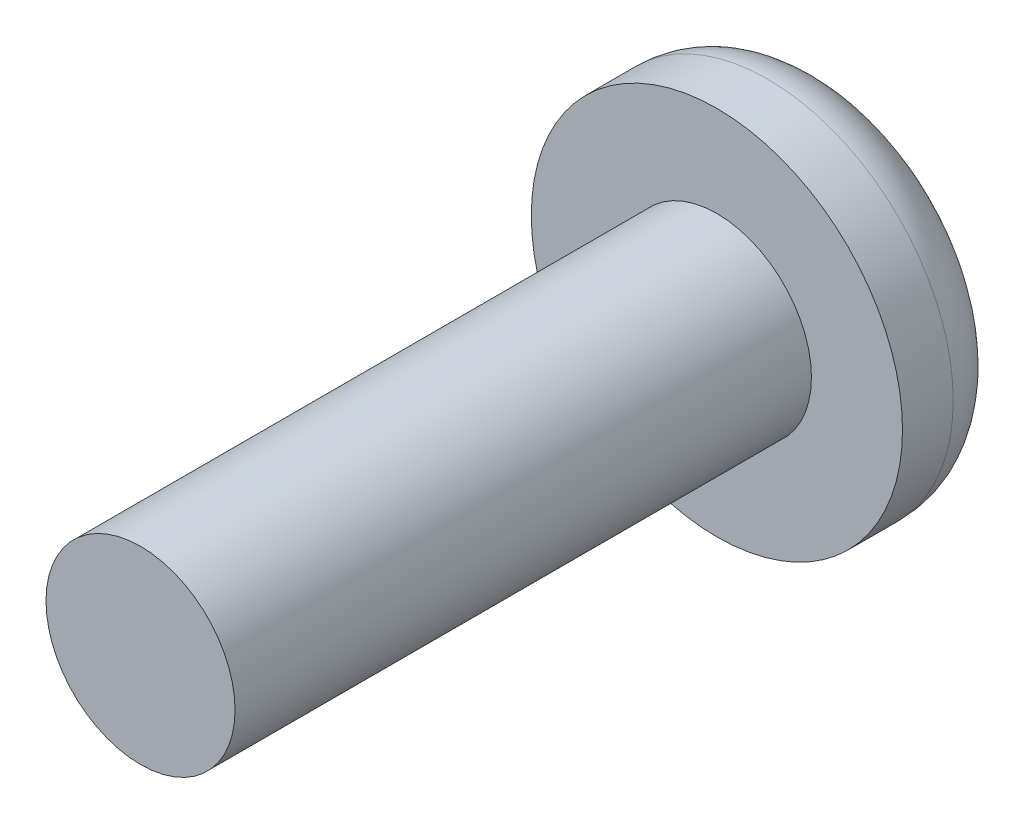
from build123d import *

# Parameters (mm, degrees)
SKETCH1_R          = 2.0828
THREADS_DEPTH      = 12.7
SKETCH2_W          = 4.0894
SKETCH2_H          = 2.4384
FILLET_2_R         = 1.3208
SKETCH4_W          = 0.9652
SKETCH4_H          = 2.0828
CUT_EXTRUDE1_DEPTH = 1.2192
CIRPATTERN2_COUNT  = 4


with BuildPart() as part:
    # Sketch1 → THREADS (new body)
    with BuildSketch(Plane.XY):
        Circle(SKETCH1_R)
    extrude(amount=THREADS_DEPTH)

    # Sketch2 → PANHEAD (revolve)
    with BuildSketch(Plane(origin=(0, 0, 0), x_dir=(1, 0, 0), z_dir=(0, 1, 0)), mode=Mode.PRIVATE) as panhead_sk:
        with Locations((2.0447, 1.2192)):
            Rectangle(SKETCH2_W, SKETCH2_H)
    revolve(panhead_sk.sketch.rotate(Axis((0, 0, -4.840317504), (0, 0, 1)), 180), axis=Axis((0, 0, -4.840317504), (0, 0, 1)))

    # FILLET 2
    fillet_2_edges = [part.edges().sort_by_distance(p)[0] for p in [
        (4.0894, 0, -2.4384),
    ]]
    fillet(fillet_2_edges, radius=FILLET_2_R)

    # Sketch4 → Cut-Extrude1 (cut)
    with BuildSketch(Plane(origin=(-0.355935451, -0.850723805, -2.4384), x_dir=(-1, 0, 0), z_dir=(0, 0, -1))):
        with Locations((-0.355935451, 1.892123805)):
            Rectangle(SKETCH4_W, SKETCH4_H)
    cut_extrude1 = extrude(amount=-CUT_EXTRUDE1_DEPTH, mode=Mode.SUBTRACT)

    # CirPattern2: Cut-Extrude1 ×4 about axis
    cirpattern2_axis = Axis((0, 0, 0), (0, 0, 1))
    for i in range(1, CIRPATTERN2_COUNT):
        add(cut_extrude1.rotate(cirpattern2_axis, i * 360 / CIRPATTERN2_COUNT), mode=Mode.SUBTRACT)


solid = part.part
